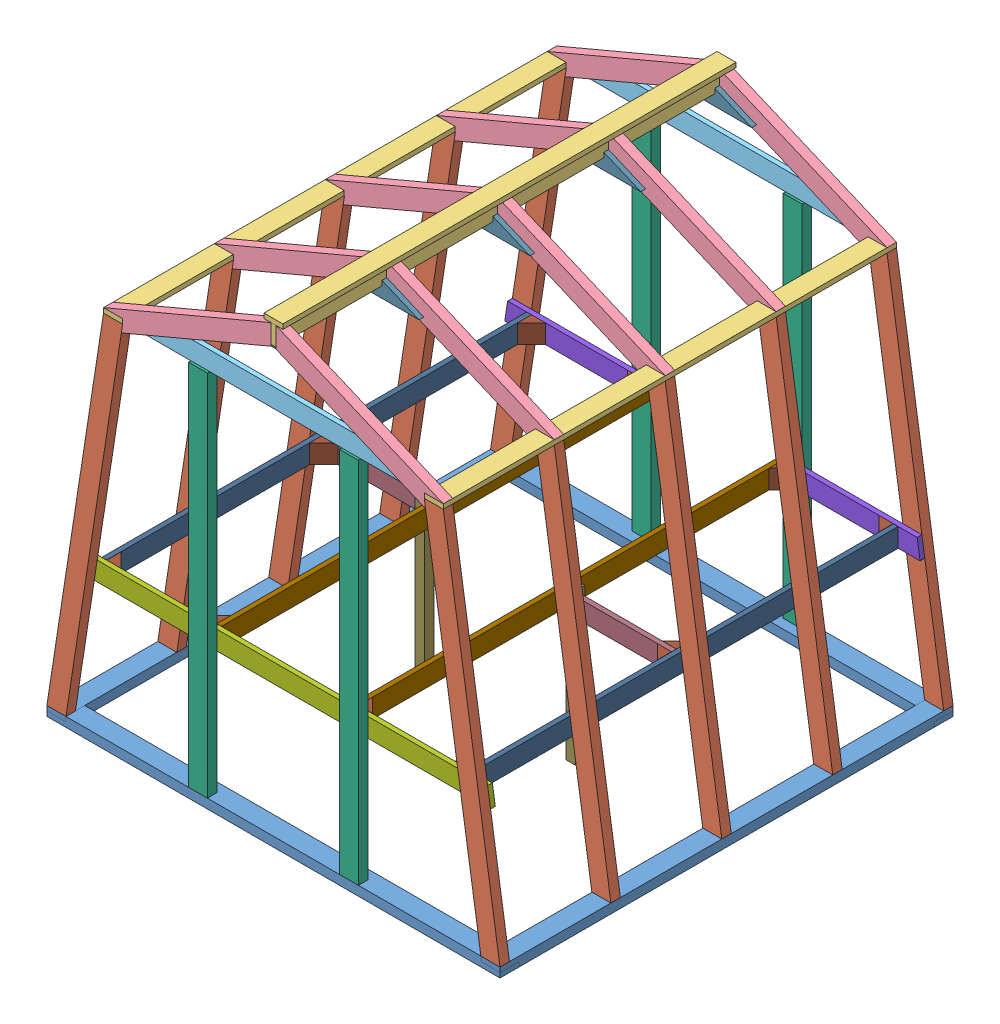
SolidWorks assembly Green house.SLDASM, configuration Default (file format 11000). Lengths in mm.
Overall size (2438.4 2463.8 2438.4).
65 component instances, 14 part files, 138 mates.
Components (placement in the parent):
- base-1: base.SLDPRT [Default] at (0 0 -2336.8) size (2438.4 50.8 101.6)
- base-2: base.SLDPRT [Default] at (-2387.6 50.8 50.8) x (0 0 1) z (1 0 0) size (2438.4 50.8 101.6)
- base-3: base.SLDPRT [Default] at origin size (2438.4 50.8 101.6)
- base-4: base.SLDPRT [Default] at (-50.8 50.8 50.8) x (0 0 1) z (1 0 0) size (2438.4 50.8 101.6)
- side-1: side.SLDPRT [Default] at (0 50.8 -1168.4) size (407.6 1981.2 50.8)
- side-2: side.SLDPRT [Default] at (0 50.8 -1117.6) x (-1 0 0) z (0 0 -1) size (407.6 1981.2 50.8)
- side-3: side.SLDPRT [Default] at (0 50.8 -571.5) size (407.6 1981.2 50.8)
- side-4: side.SLDPRT [Default] at (0 50.8 25.4) size (407.6 1981.2 50.8)
- side-5: side.SLDPRT [Default] at (0 50.8 622.3) size (407.6 1981.2 50.8)
- side-6: side.SLDPRT [Default] at (0 50.8 -520.7) x (-1 0 0) z (0 0 -1) size (407.6 1981.2 50.8)
- side-7: side.SLDPRT [Default] at (0 50.8 76.2) x (-1 0 0) z (0 0 -1) size (407.6 1981.2 50.8)
- side-8: side.SLDPRT [Default] at (0 50.8 673.1) x (-1 0 0) z (0 0 -1) size (407.6 1981.2 50.8)
- Head rail-1: Head rail.SLDPRT [Default] at (863.6 2044.7 -1168.4) size (101.6 25.4 2438.4)
- Head rail-2: Head rail.SLDPRT [Default] at (-863.6 2044.7 -1168.4) size (101.6 25.4 2438.4)
- side-9: side.SLDPRT [Default] at (0 50.8 1270) x (-1 0 0) z (0 0 -1) size (407.6 1981.2 50.8)
- side-10: side.SLDPRT [Default] at (0 50.8 1219.2) size (407.6 1981.2 50.8)
- slope-1: slope.SLDPRT [Default] at (0 2032 -1168.4) size (901.7 450.75 50.8)
- slope-2: slope.SLDPRT [Default] at (0 2032 -1117.6) x (-1 0 0) z (0 0 -1) size (901.7 450.75 50.8)
- slope-3: slope.SLDPRT [Default] at (0 2032 -520.7) x (-1 0 0) z (0 0 -1) size (901.7 450.75 50.8)
- slope-4: slope.SLDPRT [Default] at (0 2032 76.2) x (-1 0 0) z (0 0 -1) size (901.7 450.75 50.8)
- slope-5: slope.SLDPRT [Default] at (0 2032 673.1) x (-1 0 0) z (0 0 -1) size (901.7 450.75 50.8)
- slope-6: slope.SLDPRT [Default] at (0 2032 1270) x (-1 0 0) z (0 0 -1) size (901.7 450.75 50.8)
- slope-7: slope.SLDPRT [Default] at (0 2032 -571.5) size (901.7 450.75 50.8)
- slope-8: slope.SLDPRT [Default] at (0 2032 25.4) size (901.7 450.75 50.8)
- slope-9: slope.SLDPRT [Default] at (0 2032 622.3) size (901.7 450.75 50.8)
- slope-10: slope.SLDPRT [Default] at (0 2032 1219.2) size (901.7 450.75 50.8)
- Head rail-3: Head rail.SLDPRT [Default] at (0 2387.6 -1168.4) x (0 1 0) z (0 0 1) size (101.6 25.4 2438.4)
- Head rail-4: Head rail.SLDPRT [Default] at (0 2451.1 -1168.4) size (101.6 25.4 2438.4)
- header-1: header.SLDPRT [Default] at (0 2082.8 -1155.7) size (1426.95 101.6 25.4)
- header-2: header.SLDPRT [Default] at (0 2082.8 1231.9) size (1426.95 101.6 25.4)
- door-1: door.SLDPRT [Default] at (-406.4 50.8 -1143) size (101.6 1981.2 50.8)
- door-2: door.SLDPRT [Default] at (406.4 50.8 -1143) size (101.6 1981.2 50.8)
- door-3: door.SLDPRT [Default] at (-406.4 50.8 1244.6) size (101.6 1981.2 50.8)
- door-4: door.SLDPRT [Default] at (406.4 50.8 1244.6) size (101.6 1981.2 50.8)
- back board-2: back board.SLDPRT [Default] at (0 2082.8 1193.8) size (2235.2 101.6 25.4)
- front board-2: front board.SLDPRT [Default] at (0.1172 2083.562 -1117.6) size (736.48 101.6 25.4)
- front board-3: front board.SLDPRT [Default] at (-0.1172 2083.562 -1092.2) x (-1 0 0) z (0 0 -1) size (736.48 101.6 25.4)
- shelf front-1: shelf front.SLDPRT [Default] at (-368.3 762.762 -1117.6) size (25.4 101.6 2311.4)
- shelf front-2: shelf front.SLDPRT [Default] at (368.3 762.762 -1117.6) size (25.4 101.6 2311.4)
- shelf back-1: shelf back.SLDPRT [Default] at (-986.3567 762.762 -1092.2) size (25.4 101.6 2286)
- shelf back-2: shelf back.SLDPRT [Default] at (986.4739 762 -1092.2) size (25.4 101.6 2286)
- corners-1: corners.SLDPRT [Default] at (419.1 711.962 -1054.1) x (0 0 -1) z (1 0 0) size (76.2 101.6 76.2)
- corners-3: corners.SLDPRT [Default] at (935.6739 711.962 -1054.1) size (76.2 101.6 76.2)
- corners-4: corners.SLDPRT [Default] at (935.6739 711.2 1155.7) x (0 0 1) z (-1 0 0) size (76.2 101.6 76.2)
- corners-5: corners.SLDPRT [Default] at (419.1 711.962 1155.7) x (-1 0 0) z (0 0 -1) size (76.2 101.6 76.2)
- corners-6: corners.SLDPRT [Default] at (-419.1 711.962 -1054.1) size (76.2 101.6 76.2)
- corners-7: corners.SLDPRT [Default] at (-935.5567 711.962 -1054.1) x (0 0 -1) z (1 0 0) size (76.2 101.6 76.2)
- corners-8: corners.SLDPRT [Default] at (-419.1 711.962 1155.7) x (0 0 1) z (-1 0 0) size (76.2 101.6 76.2)
- corners-9: corners.SLDPRT [Default] at (-935.5567 711.2 1155.7) x (-1 0 0) z (0 0 -1) size (76.2 101.6 76.2)
- leg-1: leg.SLDPRT [Default] at (-406.4 0.762 50.8) size (50.8 812.8 50.8)
- leg-2: leg.SLDPRT [Default] at (406.4 0.762 50.8) size (50.8 812.8 50.8)
- bench spacer-1: bench spacer.SLDPRT [Default] at (381 762.762 88.9) x (0 0 -1) z (1 0 0) size (25.4 101.6 592.84)
- bench spacer-2: bench spacer.SLDPRT [Default] at (-973.836 762.762 12.7) x (0 0 -1) z (1 0 0) size (25.4 101.6 592.84)
- corners-10: corners.SLDPRT [Default] at (935.6739 812.8 38.1) x (1 0 0) z (0 0 -1) size (76.2 101.6 76.2)
- corners-11: corners.SLDPRT [Default] at (935.6739 813.562 139.7) x (0 0 -1) z (-1 0 0) size (76.2 101.6 76.2)
- corners-12: corners.SLDPRT [Default] at (-935.5567 711.962 63.5) x (0 0 -1) z (1 0 0) size (76.2 101.6 76.2)
- corners-13: corners.SLDPRT [Default] at (-935.5567 711.962 -38.1) x (-1 0 0) z (0 0 -1) size (76.2 101.6 76.2)
- roof support-1: roof support.SLDPRT [Default] at (0 2101.8905 -1117.6) size (423.51 84.11 25.4)
- roof support-2: roof support.SLDPRT [Default] at (0 2101.8905 -596.9) size (423.51 84.11 25.4)
- roof support-3: roof support.SLDPRT [Default] at (0 2101.8905 -520.7) size (423.51 84.11 25.4)
- roof support-4: roof support.SLDPRT [Default] at (0 2101.8905 0) size (423.51 84.11 25.4)
- roof support-5: roof support.SLDPRT [Default] at (0 2101.8905 76.2) size (423.51 84.11 25.4)
- roof support-6: roof support.SLDPRT [Default] at (0 2101.8905 596.9) size (423.51 84.11 25.4)
- roof support-7: roof support.SLDPRT [Default] at (0 2101.8905 673.1) size (423.51 84.11 25.4)
- roof support-8: roof support.SLDPRT [Default] at (0 2101.8905 1193.8) size (423.51 84.11 25.4)
Mates (geometry in assembly coordinates):
- Coincident1: coincident: plane of base-1 through (0 25.4 -2336.8) normal (0 1 0); plane of base-2 through (-2387.6 25.4 50.8) normal (0 -1 0)
- Coincident2: coincident: plane of base-1 through (-1117.6 25.4 -1066.8) normal (-1 0 0); plane of base-2 through (-1117.6 0 -1168.4) normal (1 0 0)
- Coincident3: coincident: plane of base-1 through (-1219.2 50.8 -1168.4) normal (0 0 -1); plane of base-2 through (-1219.2 0 -1168.4) normal (0 0 -1)
- Coincident4: coincident: plane of base-2 through (-2387.6 25.4 50.8) normal (0 -1 0); plane of base-3 through (0 25.4 0) normal (0 1 0)
- Coincident5: coincident: plane of base-2 through (-1219.2 0 -1168.4) normal (-1 0 0); plane of base-3 through (-1219.2 50.8 1168.4) normal (-1 0 0)
- Coincident6: coincident: plane of base-2 through (-1219.2 0 1270) normal (0 0 1); plane of base-3 through (-1219.2 50.8 1270) normal (0 0 1)
- Coincident8: coincident: plane of base-3 through (0 0 0) normal (0 -1 0); plane of base-4 through (-50.8 0 50.8) normal (0 -1 0)
- Coincident9: coincident: plane of base-3 through (-1219.2 50.8 1270) normal (0 0 1); plane of base-4 through (1117.6 0 1270) normal (0 0 1)
- Coincident10: coincident: plane of base-3 through (1219.2 50.8 1168.4) normal (1 0 0); plane of base-4 through (1219.2 0 -1168.4) normal (1 0 0)
- Coincident12: coordinate: point of base-3; point of assembly
- Coincident13: coincident: plane of base-1 through (-1219.2 50.8 -1168.4) normal (0 0 -1); plane of side-1 through (0 50.8 -1168.4) normal (0 0 -1)
- Coincident14: coincident: plane of base-2 through (-2387.6 50.8 50.8) normal (0 1 0); plane of side-1 through (-1219.2 50.8 -1117.6) normal (0 -1 0)
- Coincident15: coincident: line of base-2 through (-1219.2 50.8 1270) axis (0 0 -1); line of side-1 through (-1219.2 50.8 -1117.6) axis (0 0 -1)
- Coincident17: coincident: line of base-4 through (1219.2 50.8 -1168.4) axis (0 0 1); line of side-2 through (1219.2 50.8 -1168.4) axis (0 0 1)
- Coincident18: coincident: plane of base-4 through (-50.8 50.8 50.8) normal (0 1 0); plane of side-2 through (1219.2 50.8 -1168.4) normal (0 -1 0)
- Coincident19: coincident: plane of base-1 through (-1219.2 50.8 -1168.4) normal (0 0 -1); plane of side-2 through (0 50.8 -1168.4) normal (0 0 -1)
- Coincident20: coincident: plane of side-2 through (914.4 2032 -1168.4) normal (0 1 0); plane of Head rail-1 through (812.8 2032 1270) normal (0 -1 0)
- Coincident21: coincident: plane of side-2 through (0 50.8 -1168.4) normal (0 0 -1); plane of Head rail-1 through (863.6 2044.7 -1168.4) normal (0 0 -1)
- Coincident22: coincident: line of side-2 through (914.4 2032 -1168.4) axis (0 0 1); line of Head rail-1 through (914.4 2032 1270) axis (0 0 -1)
- Coincident23: coincident: plane of side-1 through (-914.4 2032 -1117.6) normal (0 1 0); plane of Head rail-2 through (-914.4 2032 1270) normal (0 -1 0)
- Coincident24: coincident: plane of side-1 through (0 50.8 -1168.4) normal (0 0 -1); plane of Head rail-2 through (-863.6 2044.7 -1168.4) normal (0 0 -1)
- Coincident25: coincident: line of side-1 through (-914.4 2032 -1117.6) axis (0 0 -1); line of Head rail-2 through (-914.4 2032 1270) axis (0 0 -1)
- Coincident26: coincident: plane of side-1 through (0 50.8 -1168.4) normal (0 0 -1); plane of slope-1 through (0 2032 -1168.4) normal (0 0 -1)
- Coincident27: coincident: plane of Head rail-2 through (-914.4 2057.4 1270) normal (0 1 0); plane of slope-1 through (-914.4 2057.4 -1117.6) normal (0 -1 0)
- Coincident28: coincident: plane of side-1 through (-1116.4047 50.8 -1117.6) normal (0.988372 -0.152057 0); plane of slope-1 through (-811.6047 2032 -1117.6) normal (-0.988372 0.152057 0)
- Coincident29: coincident: plane of side-2 through (0 50.8 -1168.4) normal (0 0 -1); plane of slope-2 through (0 2032 -1168.4) normal (0 0 -1)
- Coincident30: coincident: plane of Head rail-1 through (812.8 2057.4 1270) normal (0 1 0); plane of slope-2 through (914.4 2057.4 -1168.4) normal (0 -1 0)
- Coincident31: coincident: plane of side-2 through (1116.4047 50.8 -1168.4) normal (-0.988372 -0.152057 0); plane of slope-2 through (811.6047 2032 -1168.4) normal (0.988372 0.152057 0)
- Coincident32: coincident: plane of slope-2 through (0 2032 -1168.4) normal (0 0 -1); plane of Head rail-3 through (0 2387.6 -1168.4) normal (0 0 -1)
- Coincident33: coincident: plane of slope-1 through (-12.7 2438.4 -1117.6) normal (1 0 0); plane of Head rail-3 through (-12.7 2336.8 1270) normal (-1 0 0)
- Coincident34: coincident: plane of Head rail-3 through (-12.7 2438.4 1270) normal (0 1 0); line of slope-2 through (12.7 2438.4 -1168.4) axis (0 0 1)
- Coincident35: coincident: plane of Head rail-3 through (-12.7 2438.4 1270) normal (0 1 0); plane of Head rail-4 through (-50.8 2438.4 1270) normal (0 -1 0)
- Coincident36: coincident: plane of Head rail-3 through (0 2387.6 -1168.4) normal (0 0 -1); plane of Head rail-4 through (0 2451.1 -1168.4) normal (0 0 -1)
- Width1: width: plane of Head rail-3 through (12.7 2336.8 1270) normal (1 0 0); plane of Head rail-3 through (-12.7 2336.8 1270) normal (-1 0 0); plane of Head rail-4 through (-50.8 2463.8 1270) normal (-1 0 0); plane of Head rail-4 through (50.8 2463.8 1270) normal (1 0 0)
- Distance4: distance = 12.7 mm: plane of slope-2 through (0 2032 -1168.4) normal (0 0 -1); plane of header-1 through (0 2082.8 -1155.7) normal (0 0 -1)
- Coincident38: coincident: plane of slope-1 through (-818.427 1987.6546 -1117.6) normal (0.389217 -0.921146 0); plane of header-1 through (-713.4762 2032 -1130.3) normal (-0.389217 0.921146 0)
- Coincident39: coincident: plane of slope-2 through (818.427 1987.6546 -1168.4) normal (-0.389217 -0.921146 0); plane of header-1 through (713.4762 2032 -1130.3) normal (0.389217 0.921146 0)
- Distance7: distance = 12.7 mm: plane of slope-10 through (0 2032 1270) normal (0 0 1); plane of header-2 through (0 2082.8 1257.3) normal (0 0 1)
- Coincident41: coincident: plane of slope-6 through (818.427 1987.6546 1219.2) normal (-0.389217 -0.921146 0); plane of header-2 through (713.4762 2032 1257.3) normal (0.389217 0.921146 0)
- Coincident42: coincident: plane of slope-10 through (-818.427 1987.6546 1270) normal (0.389217 -0.921146 0); plane of header-2 through (-713.4762 2032 1257.3) normal (-0.389217 0.921146 0)
- Distance5: distance = 12.7 mm: plane of header-1 through (0 2082.8 -1155.7) normal (0 0 -1); line of door-1 through (-355.6 2032 -1168.4) axis (0 -1 0)
- Coincident45: coincident: plane of header-1 through (-713.4762 2032 -1130.3) normal (0 -1 0); plane of door-1 through (-406.4 2032 -1143) normal (0 1 0)
- Distance6: distance = 12.7 mm: plane of header-1 through (0 2082.8 -1155.7) normal (0 0 -1); plane of door-2 through (355.6 2032 -1168.4) normal (0 0 -1)
- Coincident47: coincident: plane of header-1 through (-713.4762 2032 -1130.3) normal (0 -1 0); plane of door-2 through (406.4 2032 -1143) normal (0 1 0)
- Distance2: distance = 762 mm: line of side-2 through (1219.2 50.8 -1168.4) axis (0 0 1); line of door-2 through (457.2 50.8 -1117.6) axis (0 0 -1)
- Distance3: distance = 762 mm: plane of base-2 through (-1219.2 0 -1168.4) normal (-1 0 0); plane of door-1 through (-457.2 2032 -1168.4) normal (-1 0 0)
- Coincident61: coincident: plane of door-4 through (355.6 2032 1219.2) normal (0 0 -1); plane of back board-2 through (0 2082.8 1219.2) normal (0 0 1)
- Coincident62: coincident: plane of side-9 through (1219.2 50.8 1219.2) normal (0.988372 0.152057 0); plane of back board-2 through (1117.6 711.2 1219.2) normal (0.988372 0.152057 0)
- Coincident63: coincident: plane of side-10 through (-1219.2 50.8 1270) normal (-0.988372 0.152057 0); plane of back board-2 through (-1101.9692 812.8 1219.2) normal (-0.988372 0.152057 0)
- Coincident64: coincident: plane of door-2 through (355.6 2032 -1117.6) normal (0 0 1); plane of front board-2 through (0.1172 2083.562 -1117.6) normal (0 0 -1)
- Coincident65: coincident: plane of side-1 through (-1219.2 50.8 -1117.6) normal (-0.988372 0.152057 0); plane of front board-2 through (-1101.852 813.562 -1092.2) normal (-0.988372 0.152057 0)
- Coincident67: coincident: plane of side-2 through (0 50.8 -1117.6) normal (0 0 1); plane of front board-3 through (-0.1172 2083.562 -1117.6) normal (0 0 -1)
- Distance12: distance = 25.4 mm: plane of front board-2 through (-381 813.562 -1092.2) normal (1 0 0); plane of door-1 through (-355.6 2032 -1168.4) normal (1 0 0)
- Distance13: distance = 25.4 mm: plane of front board-3 through (381 813.562 -1117.6) normal (-1 0 0); plane of door-2 through (355.6 2032 -1168.4) normal (-1 0 0)
- Coincident70: coincident: plane of front board-2 through (-381 813.562 -1092.2) normal (1 0 0); plane of shelf front-1 through (-381 711.962 1193.8) normal (-1 0 0)
- Coincident71: coincident: plane of front board-2 through (-1101.852 813.562 -1092.2) normal (0 1 0); plane of shelf front-1 through (-381 813.562 1193.8) normal (0 1 0)
- Coincident72: coincident: plane of door-1 through (-457.2 2032 -1117.6) normal (0 0 1); plane of shelf front-1 through (-368.3 762.762 -1117.6) normal (0 0 -1)
- Coincident73: coincident: plane of front board-3 through (381 813.562 -1117.6) normal (-1 0 0); plane of shelf front-2 through (381 711.962 1193.8) normal (1 0 0)
- Coincident74: coincident: plane of front board-3 through (1101.852 813.562 -1117.6) normal (0 1 0); plane of shelf front-2 through (355.6 813.562 1193.8) normal (0 1 0)
- Coincident75: coincident: plane of door-2 through (355.6 2032 -1117.6) normal (0 0 1); plane of shelf front-2 through (368.3 762.762 -1117.6) normal (0 0 -1)
- Coincident76: coincident: plane of front board-2 through (-1101.852 813.562 -1092.2) normal (0 1 0); plane of shelf back-1 through (-999.0567 813.562 1193.8) normal (0 1 0)
- Coincident77: coincident: plane of front board-2 through (0.1172 2083.562 -1092.2) normal (0 0 1); plane of shelf back-1 through (-986.3567 762.762 -1092.2) normal (0 0 -1)
- Coincident78: coincident: plane of side-3 through (-1116.4047 50.8 -520.7) normal (0.988372 -0.152057 0); line of shelf back-1 through (-999.0567 813.562 1193.8) axis (0 0 -1)
- Coincident79: coincident: plane of back board-2 through (-1101.9692 812.8 1219.2) normal (0 1 0); plane of shelf back-2 through (973.7739 812.8 1193.8) normal (0 1 0)
- Coincident80: coincident: plane of front board-3 through (-0.1172 2083.562 -1092.2) normal (0 0 1); plane of shelf back-2 through (986.4739 762 -1092.2) normal (0 0 -1)
- Coincident81: coincident: plane of side-6 through (1116.4047 50.8 -571.5) normal (-0.988372 -0.152057 0); line of shelf back-2 through (999.1739 812.8 1193.8) axis (0 0 -1)
- Coincident82: coincident: plane of front board-3 through (-0.1172 2083.562 -1092.2) normal (0 0 1); plane of corners-1 through (381 813.562 -1092.2) normal (0 0 -1)
- Coincident83: coincident: plane of shelf front-2 through (381 711.962 1193.8) normal (1 0 0); plane of corners-1 through (381 813.562 -1016) normal (-1 0 0)
- Coincident84: coincident: plane of shelf front-2 through (355.6 813.562 1193.8) normal (0 1 0); plane of corners-1 through (419.1 813.562 -1054.1) normal (0 1 0)
- Coincident89: coincident: plane of shelf back-2 through (973.7739 711.2 1193.8) normal (-1 0 0); plane of corners-3 through (973.7739 813.562 -1092.2) normal (1 0 0)
- Coincident90: coincident: plane of front board-3 through (-0.1172 2083.562 -1092.2) normal (0 0 1); plane of corners-3 through (897.5739 813.562 -1092.2) normal (0 0 -1)
- Coincident91: coincident: plane of front board-3 through (1117.4828 711.962 -1117.6) normal (0 -1 0); plane of corners-3 through (935.6739 711.962 -1054.1) normal (0 -1 0)
- Coincident92: coincident: plane of back board-2 through (0 2082.8 1193.8) normal (0 0 -1); plane of corners-4 through (973.7739 812.8 1193.8) normal (0 0 1)
- Coincident93: coincident: plane of shelf back-2 through (973.7739 711.2 1193.8) normal (-1 0 0); plane of corners-4 through (973.7739 812.8 1117.6) normal (1 0 0)
- Coincident94: coincident: plane of back board-2 through (-1101.9692 812.8 1219.2) normal (0 1 0); plane of corners-4 through (935.6739 812.8 1155.7) normal (0 1 0)
- Coincident95: coincident: plane of shelf front-2 through (381 711.962 1193.8) normal (1 0 0); plane of corners-5 through (381 813.562 1193.8) normal (-1 0 0)
- Coincident96: coincident: plane of back board-2 through (0 2082.8 1193.8) normal (0 0 -1); plane of corners-5 through (457.2 813.562 1193.8) normal (0 0 1)
- Coincident97: coincident: plane of shelf front-2 through (355.6 813.562 1193.8) normal (0 1 0); plane of corners-5 through (419.1 813.562 1155.7) normal (0 1 0)
- Coincident98: coincident: plane of front board-2 through (0.1172 2083.562 -1092.2) normal (0 0 1); plane of corners-6 through (-457.2 813.562 -1092.2) normal (0 0 -1)
- Coincident99: coincident: plane of shelf front-1 through (-381 711.962 1193.8) normal (-1 0 0); plane of corners-6 through (-381 813.562 -1092.2) normal (1 0 0)
- Coincident100: coincident: plane of shelf front-1 through (-381 813.562 1193.8) normal (0 1 0); plane of corners-6 through (-419.1 813.562 -1054.1) normal (0 1 0)
- Coincident101: coincident: plane of shelf back-1 through (-973.6567 711.962 1193.8) normal (1 0 0); plane of corners-7 through (-973.6567 813.562 -1016) normal (-1 0 0)
- Coincident102: coincident: plane of front board-2 through (0.1172 2083.562 -1092.2) normal (0 0 1); plane of corners-7 through (-973.6567 813.562 -1092.2) normal (0 0 -1)
- Coincident103: coincident: plane of shelf back-1 through (-999.0567 813.562 1193.8) normal (0 1 0); plane of corners-7 through (-935.5567 813.562 -1054.1) normal (0 1 0)
- Coincident104: coincident: plane of shelf front-1 through (-381 711.962 1193.8) normal (-1 0 0); plane of corners-8 through (-381 813.562 1117.6) normal (1 0 0)
- Coincident105: coincident: plane of shelf front-1 through (-381 813.562 1193.8) normal (0 1 0); plane of corners-8 through (-419.1 813.562 1155.7) normal (0 1 0)
- Coincident106: coincident: plane of back board-2 through (0 2082.8 1193.8) normal (0 0 -1); plane of corners-8 through (-381 813.562 1193.8) normal (0 0 1)
- Coincident107: coincident: plane of back board-2 through (0 2082.8 1193.8) normal (0 0 -1); plane of corners-9 through (-897.4567 812.8 1193.8) normal (0 0 1)
- Coincident108: coincident: plane of back board-2 through (-1101.9692 812.8 1219.2) normal (0 1 0); plane of corners-9 through (-935.5567 812.8 1155.7) normal (0 1 0)
- Coincident109: coincident: plane of shelf back-1 through (-973.6567 711.962 1193.8) normal (1 0 0); plane of corners-9 through (-973.6567 812.8 1193.8) normal (-1 0 0)
- Coincident110: coincident: plane of shelf front-1 through (-381 711.962 1193.8) normal (-1 0 0); plane of leg-1 through (-381 813.562 25.4) normal (1 0 0)
- Coincident111: coincident: plane of shelf front-1 through (-381 813.562 1193.8) normal (0 1 0); plane of leg-1 through (-406.4 813.562 50.8) normal (0 1 0)
- Width2: width: plane of leg-1 through (-431.8 813.562 76.2) normal (0 0 1); plane of leg-1 through (-431.8 813.562 25.4) normal (0 0 -1); plane of back board-2 through (0 2082.8 1193.8) normal (0 0 -1); plane of front board-2 through (0.1172 2083.562 -1092.2) normal (0 0 1)
- Coincident112: coincident: plane of shelf front-2 through (381 711.962 1193.8) normal (1 0 0); plane of leg-2 through (381 813.562 25.4) normal (-1 0 0)
- Coincident113: coincident: plane of shelf front-2 through (355.6 813.562 1193.8) normal (0 1 0); plane of leg-2 through (406.4 813.562 50.8) normal (0 1 0)
- Width3: width: plane of leg-2 through (381 813.562 25.4) normal (0 0 -1); plane of leg-2 through (381 813.562 76.2) normal (0 0 1); plane of front board-3 through (-0.1172 2083.562 -1092.2) normal (0 0 1); plane of back board-2 through (0 2082.8 1193.8) normal (0 0 -1)
- Coincident114: coincident: plane of shelf front-2 through (381 711.962 1193.8) normal (1 0 0); plane of bench spacer-1 through (381 762.762 88.9) normal (-1 0 0)
- Coincident115: coincident: plane of shelf front-2 through (355.6 813.562 1193.8) normal (0 1 0); plane of bench spacer-1 through (973.836 813.562 101.6) normal (0 1 0)
- Coincident116: coincident: plane of leg-2 through (381 813.562 76.2) normal (0 0 1); plane of bench spacer-1 through (973.836 711.962 76.2) normal (0 0 -1)
- Coincident117: coincident: plane of leg-1 through (-431.8 813.562 25.4) normal (0 0 -1); plane of bench spacer-2 through (-381 711.962 25.4) normal (0 0 1)
- Coincident118: coincident: plane of leg-1 through (-406.4 813.562 50.8) normal (0 1 0); plane of bench spacer-2 through (-381 813.562 25.4) normal (0 1 0)
- Coincident119: coincident: plane of shelf front-1 through (-381 711.962 1193.8) normal (-1 0 0); plane of bench spacer-2 through (-381 762.762 12.7) normal (1 0 0)
- Coincident120: coincident: plane of bench spacer-1 through (973.836 711.962 76.2) normal (0 0 -1); plane of corners-10 through (897.5739 711.2 76.2) normal (0 0 1)
- Coincident121: coincident: plane of shelf back-2 through (973.7739 711.2 1193.8) normal (-1 0 0); plane of corners-10 through (973.7739 711.2 76.2) normal (1 0 0)
- Coincident122: coincident: plane of shelf back-2 through (973.7739 812.8 1193.8) normal (0 1 0); plane of corners-10 through (935.6739 812.8 38.1) normal (0 1 0)
- Coincident123: coincident: plane of bench spacer-1 through (973.836 711.962 101.6) normal (0 0 1); plane of corners-11 through (973.7739 711.962 101.6) normal (0 0 -1)
- Coincident124: coincident: plane of shelf back-2 through (973.7739 711.2 1193.8) normal (-1 0 0); plane of corners-11 through (973.7739 711.962 177.8) normal (1 0 0)
- Coincident125: coincident: plane of bench spacer-1 through (973.836 813.562 101.6) normal (0 1 0); plane of corners-11 through (935.6739 813.562 139.7) normal (0 1 0)
- Coincident126: coincident: plane of shelf back-1 through (-973.6567 711.962 1193.8) normal (1 0 0); plane of corners-12 through (-973.6567 813.562 101.6) normal (-1 0 0)
- Coincident127: coincident: plane of bench spacer-2 through (-381 711.962 25.4) normal (0 0 1); plane of corners-12 through (-973.6567 813.562 25.4) normal (0 0 -1)
- Coincident128: coincident: plane of bench spacer-2 through (-381 813.562 25.4) normal (0 1 0); plane of corners-12 through (-935.5567 813.562 63.5) normal (0 1 0)
- Coincident129: coincident: plane of bench spacer-2 through (-381 711.962 0) normal (0 0 -1); plane of corners-13 through (-897.4567 813.562 0) normal (0 0 1)
- Coincident130: coincident: plane of bench spacer-2 through (-381 813.562 25.4) normal (0 1 0); plane of corners-13 through (-935.5567 813.562 -38.1) normal (0 1 0)
- Coincident131: coincident: plane of shelf back-1 through (-973.6567 711.962 1193.8) normal (1 0 0); plane of corners-13 through (-973.6567 813.562 0) normal (-1 0 0)
- Coincident132: coincident: plane of slope-1 through (0 2032 -1117.6) normal (0 0 1); plane of roof support-1 through (0 2101.8905 -1117.6) normal (0 0 -1)
- Coincident133: coincident: plane of Head rail-3 through (-12.7 2336.8 1270) normal (0 -1 0); plane of roof support-1 through (0 2336.8 -1092.2) normal (0 1 0)
- Coincident134: coincident: plane of Head rail-3 through (12.7 2336.8 1270) normal (1 0 0); plane of roof support-1 through (12.7 2101.8905 -1092.2) normal (-1 0 0)
- Coincident136: coincident: plane of slope-7 through (0 2032 -571.5) normal (0 0 -1); plane of roof support-2 through (0 2101.8905 -571.5) normal (0 0 1)
- Coincident137: coincident: plane of Head rail-3 through (-12.7 2336.8 1270) normal (0 -1 0); plane of roof support-2 through (0 2336.8 -571.5) normal (0 1 0)
- Coincident138: coincident: plane of Head rail-3 through (-12.7 2336.8 1270) normal (-1 0 0); plane of roof support-2 through (-12.7 2101.8905 -571.5) normal (1 0 0)
- Coincident139: coincident: plane of slope-7 through (0 2032 -520.7) normal (0 0 1); plane of roof support-3 through (0 2101.8905 -520.7) normal (0 0 -1)
- Coincident140: coincident: plane of Head rail-3 through (12.7 2336.8 1270) normal (1 0 0); plane of roof support-3 through (12.7 2101.8905 -495.3) normal (-1 0 0)
- Coincident141: coincident: plane of Head rail-3 through (-12.7 2336.8 1270) normal (0 -1 0); plane of roof support-3 through (0 2336.8 -495.3) normal (0 1 0)
- Coincident142: coincident: plane of slope-4 through (0 2032 25.4) normal (0 0 -1); plane of roof support-4 through (0 2101.8905 25.4) normal (0 0 1)
- Coincident143: coincident: plane of Head rail-3 through (-12.7 2336.8 1270) normal (0 -1 0); plane of roof support-4 through (0 2336.8 25.4) normal (0 1 0)
- Coincident144: coincident: plane of Head rail-3 through (12.7 2336.8 1270) normal (1 0 0); plane of roof support-4 through (12.7 2101.8905 25.4) normal (-1 0 0)
- Coincident145: coincident: plane of slope-4 through (0 2032 76.2) normal (0 0 1); plane of roof support-5 through (0 2101.8905 76.2) normal (0 0 -1)
- Coincident146: coincident: plane of Head rail-3 through (-12.7 2336.8 1270) normal (0 -1 0); plane of roof support-5 through (0 2336.8 101.6) normal (0 1 0)
- Coincident147: coincident: plane of Head rail-3 through (-12.7 2336.8 1270) normal (-1 0 0); plane of roof support-5 through (-12.7 2101.8905 101.6) normal (1 0 0)
- Coincident148: coincident: plane of slope-9 through (0 2032 622.3) normal (0 0 -1); plane of roof support-6 through (0 2101.8905 622.3) normal (0 0 1)
- Coincident149: coincident: plane of Head rail-3 through (-12.7 2336.8 1270) normal (0 -1 0); plane of roof support-6 through (0 2336.8 622.3) normal (0 1 0)
- Coincident150: coincident: plane of Head rail-3 through (-12.7 2336.8 1270) normal (-1 0 0); plane of roof support-6 through (-12.7 2101.8905 622.3) normal (1 0 0)
- Coincident151: coincident: plane of slope-9 through (0 2032 673.1) normal (0 0 1); plane of roof support-7 through (0 2101.8905 673.1) normal (0 0 -1)
- Coincident152: coincident: plane of Head rail-3 through (12.7 2336.8 1270) normal (1 0 0); plane of roof support-7 through (12.7 2101.8905 698.5) normal (-1 0 0)
- Coincident153: coincident: plane of Head rail-3 through (-12.7 2336.8 1270) normal (0 -1 0); plane of roof support-7 through (0 2336.8 698.5) normal (0 1 0)
- Coincident154: coincident: plane of slope-10 through (0 2032 1219.2) normal (0 0 -1); plane of roof support-8 through (0 2079.5556 1219.2) normal (0 0 1)
- Coincident155: coincident: plane of Head rail-3 through (12.7 2336.8 1270) normal (1 0 0); plane of roof support-8 through (12.7 2079.5556 1219.2) normal (-1 0 0)
- Coincident156: coincident: plane of Head rail-3 through (-12.7 2336.8 1270) normal (0 -1 0); plane of roof support-8 through (0 2336.8 1219.2) normal (0 1 0)
